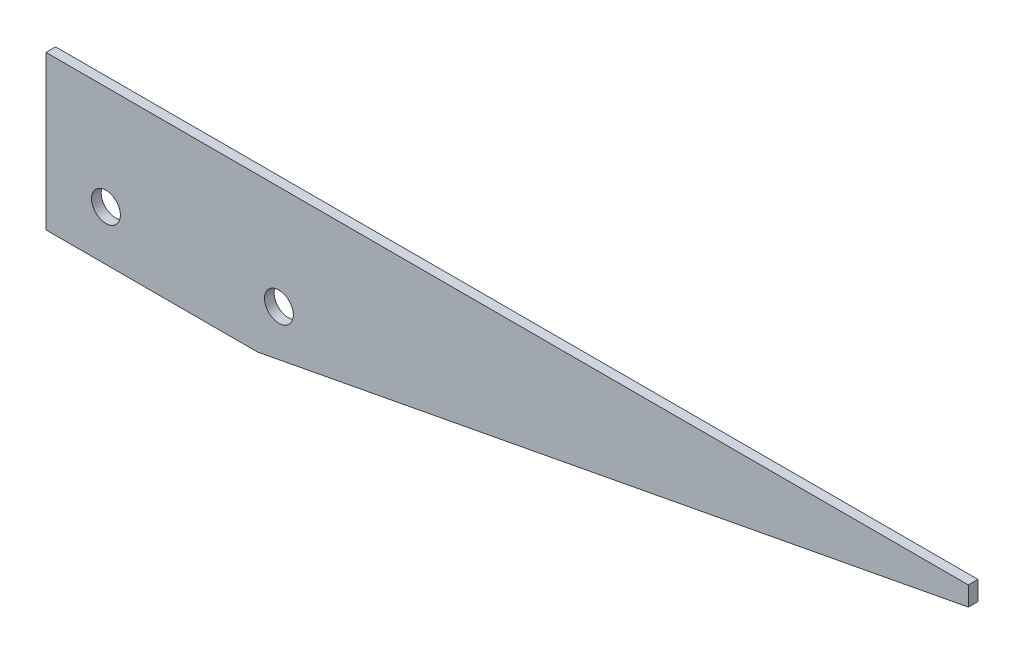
ISO-10303-21;
HEADER;
FILE_DESCRIPTION(('STEP AP214'),'2;1');
FILE_NAME('part.step','',(''),(''),'','','');
FILE_SCHEMA(('AUTOMOTIVE_DESIGN { 1 0 10303 214 1 1 1 1 }'));
ENDSEC;
DATA;
#1=APPLICATION_CONTEXT('core data for automotive mechanical design processes');
#2=APPLICATION_PROTOCOL_DEFINITION('international standard','automotive_design',2000,#1);
#3=PRODUCT_CONTEXT('',#1,'mechanical');
#4=PRODUCT('Part','Part','',(#3));
#5=PRODUCT_RELATED_PRODUCT_CATEGORY('part','',(#4));
#6=PRODUCT_DEFINITION_FORMATION('','',#4);
#7=PRODUCT_DEFINITION_CONTEXT('part definition',#1,'design');
#8=PRODUCT_DEFINITION('design','',#6,#7);
#9=PRODUCT_DEFINITION_SHAPE('','',#8);
#10=(LENGTH_UNIT() NAMED_UNIT(*) SI_UNIT(.MILLI.,.METRE.));
#11=(NAMED_UNIT(*) PLANE_ANGLE_UNIT() SI_UNIT($,.RADIAN.));
#12=(NAMED_UNIT(*) SI_UNIT($,.STERADIAN.) SOLID_ANGLE_UNIT());
#13=UNCERTAINTY_MEASURE_WITH_UNIT(LENGTH_MEASURE(1.E-05),#10,'distance_accuracy_value','');
#14=(GEOMETRIC_REPRESENTATION_CONTEXT(3) GLOBAL_UNCERTAINTY_ASSIGNED_CONTEXT((#13)) GLOBAL_UNIT_ASSIGNED_CONTEXT((#10,
#11,#12)) REPRESENTATION_CONTEXT('',''));
#15=CARTESIAN_POINT('',(0.,0.,0.));
#16=DIRECTION('',(0.,0.,1.));
#17=DIRECTION('',(1.,0.,0.));
#18=AXIS2_PLACEMENT_3D('',#15,#16,#17);
#19=CARTESIAN_POINT('',(0.,0.,3.17499999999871));
#20=DIRECTION('',(0.,0.,-1.));
#21=DIRECTION('',(-1.,0.,0.));
#22=AXIS2_PLACEMENT_3D('',#19,#20,#21);
#23=PLANE('',#22);
#24=CARTESIAN_POINT('',(-92.644451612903,3.19548387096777,3.17499999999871));
#25=DIRECTION('',(0.,0.,1.));
#26=DIRECTION('',(1.,0.,0.));
#27=AXIS2_PLACEMENT_3D('',#24,#25,#26);
#28=CIRCLE('',#27,4.7625);
#29=CARTESIAN_POINT('',(-87.881951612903,3.19548387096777,3.17499999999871));
#30=VERTEX_POINT('',#29);
#31=EDGE_CURVE('E119',#30,#30,#28,.T.);
#32=ORIENTED_EDGE('',*,*,#31,.F.);
#33=EDGE_LOOP('',(#32));
#34=FACE_BOUND('',#33,.T.);
#35=DIRECTION('',(0.,-1.,0.));
#36=VECTOR('',#35,1.);
#37=CARTESIAN_POINT('',(-112.456451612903,-13.3145161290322,3.17499999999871));
#38=LINE('',#37,#36);
#39=CARTESIAN_POINT('',(-112.456451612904,37.4854838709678,3.17499999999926));
#40=VERTEX_POINT('',#39);
#41=CARTESIAN_POINT('',(-112.456451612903,-13.3145161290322,3.17499999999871));
#42=VERTEX_POINT('',#41);
#43=EDGE_CURVE('E124',#40,#42,#38,.T.);
#44=ORIENTED_EDGE('',*,*,#43,.T.);
#45=DIRECTION('',(1.,0.,0.));
#46=VECTOR('',#45,1.);
#47=CARTESIAN_POINT('',(-42.6064516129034,-13.3145161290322,3.17499999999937));
#48=LINE('',#47,#46);
#49=CARTESIAN_POINT('',(-42.6064516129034,-13.3145161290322,3.17499999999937));
#50=VERTEX_POINT('',#49);
#51=EDGE_CURVE('E91',#42,#50,#48,.T.);
#52=ORIENTED_EDGE('',*,*,#51,.T.);
#53=DIRECTION('',(0.982570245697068,0.185891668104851,0.));
#54=VECTOR('',#53,1.);
#55=CARTESIAN_POINT('',(192.343548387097,31.1354838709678,3.17499999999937));
#56=LINE('',#55,#54);
#57=CARTESIAN_POINT('',(192.343548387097,31.1354838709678,3.17499999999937));
#58=VERTEX_POINT('',#57);
#59=EDGE_CURVE('E95',#50,#58,#56,.T.);
#60=ORIENTED_EDGE('',*,*,#59,.T.);
#61=DIRECTION('',(0.,1.,0.));
#62=VECTOR('',#61,1.);
#63=CARTESIAN_POINT('',(192.343548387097,37.4854838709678,3.17499999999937));
#64=LINE('',#63,#62);
#65=CARTESIAN_POINT('',(192.343548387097,37.4854838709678,3.17499999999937));
#66=VERTEX_POINT('',#65);
#67=EDGE_CURVE('E99',#58,#66,#64,.T.);
#68=ORIENTED_EDGE('',*,*,#67,.T.);
#69=DIRECTION('',(-1.,0.,0.));
#70=VECTOR('',#69,1.);
#71=CARTESIAN_POINT('',(-112.456451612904,37.4854838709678,3.17499999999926));
#72=LINE('',#71,#70);
#73=EDGE_CURVE('E57',#66,#40,#72,.T.);
#74=ORIENTED_EDGE('',*,*,#73,.T.);
#75=EDGE_LOOP('',(#44,#52,#60,#68,#74));
#76=FACE_BOUND('',#75,.T.);
#77=CARTESIAN_POINT('',(-35.4944516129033,3.19548387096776,3.17499999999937));
#78=DIRECTION('',(0.,0.,1.));
#79=DIRECTION('',(1.,0.,0.));
#80=AXIS2_PLACEMENT_3D('',#77,#78,#79);
#81=CIRCLE('',#80,4.7625);
#82=CARTESIAN_POINT('',(-30.7319516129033,3.19548387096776,3.17499999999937));
#83=VERTEX_POINT('',#82);
#84=EDGE_CURVE('E162',#83,#83,#81,.T.);
#85=ORIENTED_EDGE('',*,*,#84,.F.);
#86=EDGE_LOOP('',(#85));
#87=FACE_BOUND('',#86,.T.);
#88=ADVANCED_FACE('F40',(#34,#76,#87),#23,.F.);
#89=CARTESIAN_POINT('',(0.,0.,0.));
#90=DIRECTION('',(0.,0.,-1.));
#91=DIRECTION('',(-1.,0.,0.));
#92=AXIS2_PLACEMENT_3D('',#89,#90,#91);
#93=PLANE('',#92);
#94=CARTESIAN_POINT('',(-92.6444516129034,3.19548387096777,0.));
#95=DIRECTION('',(0.,0.,1.));
#96=DIRECTION('',(1.,0.,0.));
#97=AXIS2_PLACEMENT_3D('',#94,#95,#96);
#98=CIRCLE('',#97,4.7625);
#99=CARTESIAN_POINT('',(-87.8819516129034,3.19548387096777,0.));
#100=VERTEX_POINT('',#99);
#101=EDGE_CURVE('E167',#100,#100,#98,.T.);
#102=ORIENTED_EDGE('',*,*,#101,.T.);
#103=EDGE_LOOP('',(#102));
#104=FACE_BOUND('',#103,.T.);
#105=DIRECTION('',(0.,-1.,0.));
#106=VECTOR('',#105,1.);
#107=CARTESIAN_POINT('',(-112.456451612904,-13.3145161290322,0.));
#108=LINE('',#107,#106);
#109=CARTESIAN_POINT('',(-112.456451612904,37.4854838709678,0.));
#110=VERTEX_POINT('',#109);
#111=CARTESIAN_POINT('',(-112.456451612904,-13.3145161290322,0.));
#112=VERTEX_POINT('',#111);
#113=EDGE_CURVE('E115',#110,#112,#108,.T.);
#114=ORIENTED_EDGE('',*,*,#113,.F.);
#115=DIRECTION('',(-1.,0.,0.));
#116=VECTOR('',#115,1.);
#117=CARTESIAN_POINT('',(-112.456451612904,37.4854838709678,0.));
#118=LINE('',#117,#116);
#119=CARTESIAN_POINT('',(192.343548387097,37.4854838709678,-3.33066907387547E-13));
#120=VERTEX_POINT('',#119);
#121=EDGE_CURVE('E83',#120,#110,#118,.T.);
#122=ORIENTED_EDGE('',*,*,#121,.F.);
#123=DIRECTION('',(0.,1.,0.));
#124=VECTOR('',#123,1.);
#125=CARTESIAN_POINT('',(192.343548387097,37.4854838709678,-3.33066907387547E-13));
#126=LINE('',#125,#124);
#127=CARTESIAN_POINT('',(192.343548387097,31.1354838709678,-3.33066907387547E-13));
#128=VERTEX_POINT('',#127);
#129=EDGE_CURVE('E77',#128,#120,#126,.T.);
#130=ORIENTED_EDGE('',*,*,#129,.F.);
#131=DIRECTION('',(0.982570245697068,0.185891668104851,0.));
#132=VECTOR('',#131,1.);
#133=CARTESIAN_POINT('',(192.343548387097,31.1354838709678,-3.33066907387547E-13));
#134=LINE('',#133,#132);
#135=CARTESIAN_POINT('',(-42.6064516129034,-13.3145161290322,-6.66133814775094E-13));
#136=VERTEX_POINT('',#135);
#137=EDGE_CURVE('E106',#136,#128,#134,.T.);
#138=ORIENTED_EDGE('',*,*,#137,.F.);
#139=DIRECTION('',(1.,0.,0.));
#140=VECTOR('',#139,1.);
#141=CARTESIAN_POINT('',(-42.6064516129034,-13.3145161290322,-6.66133814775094E-13));
#142=LINE('',#141,#140);
#143=EDGE_CURVE('E118',#112,#136,#142,.T.);
#144=ORIENTED_EDGE('',*,*,#143,.F.);
#145=EDGE_LOOP('',(#114,#122,#130,#138,#144));
#146=FACE_BOUND('',#145,.T.);
#147=CARTESIAN_POINT('',(-35.4944516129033,3.19548387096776,-6.66133814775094E-13));
#148=DIRECTION('',(0.,0.,1.));
#149=DIRECTION('',(1.,0.,0.));
#150=AXIS2_PLACEMENT_3D('',#147,#148,#149);
#151=CIRCLE('',#150,4.7625);
#152=CARTESIAN_POINT('',(-30.7319516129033,3.19548387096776,-6.66133814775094E-13));
#153=VERTEX_POINT('',#152);
#154=EDGE_CURVE('E165',#153,#153,#151,.T.);
#155=ORIENTED_EDGE('',*,*,#154,.T.);
#156=EDGE_LOOP('',(#155));
#157=FACE_BOUND('',#156,.T.);
#158=ADVANCED_FACE('F128',(#104,#146,#157),#93,.T.);
#159=CARTESIAN_POINT('',(-112.456451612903,-13.3145161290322,3.17499999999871));
#160=DIRECTION('',(1.,0.,0.));
#161=DIRECTION('',(0.,0.,-1.));
#162=AXIS2_PLACEMENT_3D('',#159,#160,#161);
#163=PLANE('',#162);
#164=ORIENTED_EDGE('',*,*,#113,.T.);
#165=DIRECTION('',(0.,0.,-1.));
#166=VECTOR('',#165,1.);
#167=CARTESIAN_POINT('',(-112.456451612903,-13.3145161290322,3.17499999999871));
#168=LINE('',#167,#166);
#169=EDGE_CURVE('E13',#42,#112,#168,.T.);
#170=ORIENTED_EDGE('',*,*,#169,.F.);
#171=ORIENTED_EDGE('',*,*,#43,.F.);
#172=DIRECTION('',(0.,0.,-1.));
#173=VECTOR('',#172,1.);
#174=CARTESIAN_POINT('',(-112.456451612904,37.4854838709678,3.17499999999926));
#175=LINE('',#174,#173);
#176=EDGE_CURVE('E111',#40,#110,#175,.T.);
#177=ORIENTED_EDGE('',*,*,#176,.T.);
#178=EDGE_LOOP('',(#164,#170,#171,#177));
#179=FACE_BOUND('',#178,.T.);
#180=ADVANCED_FACE('F42',(#179),#163,.F.);
#181=CARTESIAN_POINT('',(-42.6064516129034,-13.3145161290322,3.17499999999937));
#182=DIRECTION('',(0.,1.,0.));
#183=DIRECTION('',(-1.,0.,0.));
#184=AXIS2_PLACEMENT_3D('',#181,#182,#183);
#185=PLANE('',#184);
#186=ORIENTED_EDGE('',*,*,#143,.T.);
#187=DIRECTION('',(0.,0.,-1.));
#188=VECTOR('',#187,1.);
#189=CARTESIAN_POINT('',(-42.6064516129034,-13.3145161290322,3.17499999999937));
#190=LINE('',#189,#188);
#191=EDGE_CURVE('E49',#50,#136,#190,.T.);
#192=ORIENTED_EDGE('',*,*,#191,.F.);
#193=ORIENTED_EDGE('',*,*,#51,.F.);
#194=ORIENTED_EDGE('',*,*,#169,.T.);
#195=EDGE_LOOP('',(#186,#192,#193,#194));
#196=FACE_BOUND('',#195,.T.);
#197=ADVANCED_FACE('F193',(#196),#185,.F.);
#198=CARTESIAN_POINT('',(192.343548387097,31.1354838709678,3.17499999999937));
#199=DIRECTION('',(-0.185891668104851,0.982570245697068,0.));
#200=DIRECTION('',(-0.982570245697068,-0.185891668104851,0.));
#201=AXIS2_PLACEMENT_3D('',#198,#199,#200);
#202=PLANE('',#201);
#203=ORIENTED_EDGE('',*,*,#137,.T.);
#204=DIRECTION('',(0.,0.,-1.));
#205=VECTOR('',#204,1.);
#206=CARTESIAN_POINT('',(192.343548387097,31.1354838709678,3.17499999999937));
#207=LINE('',#206,#205);
#208=EDGE_CURVE('E103',#58,#128,#207,.T.);
#209=ORIENTED_EDGE('',*,*,#208,.F.);
#210=ORIENTED_EDGE('',*,*,#59,.F.);
#211=ORIENTED_EDGE('',*,*,#191,.T.);
#212=EDGE_LOOP('',(#203,#209,#210,#211));
#213=FACE_BOUND('',#212,.T.);
#214=ADVANCED_FACE('F104',(#213),#202,.F.);
#215=CARTESIAN_POINT('',(192.343548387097,37.4854838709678,3.17499999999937));
#216=DIRECTION('',(-1.,0.,0.));
#217=DIRECTION('',(0.,0.,1.));
#218=AXIS2_PLACEMENT_3D('',#215,#216,#217);
#219=PLANE('',#218);
#220=ORIENTED_EDGE('',*,*,#129,.T.);
#221=DIRECTION('',(0.,0.,-1.));
#222=VECTOR('',#221,1.);
#223=CARTESIAN_POINT('',(192.343548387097,37.4854838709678,3.17499999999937));
#224=LINE('',#223,#222);
#225=EDGE_CURVE('E107',#66,#120,#224,.T.);
#226=ORIENTED_EDGE('',*,*,#225,.F.);
#227=ORIENTED_EDGE('',*,*,#67,.F.);
#228=ORIENTED_EDGE('',*,*,#208,.T.);
#229=EDGE_LOOP('',(#220,#226,#227,#228));
#230=FACE_BOUND('',#229,.T.);
#231=ADVANCED_FACE('F109',(#230),#219,.F.);
#232=CARTESIAN_POINT('',(-112.456451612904,37.4854838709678,3.17499999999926));
#233=DIRECTION('',(0.,-1.,0.));
#234=DIRECTION('',(0.,0.,-1.));
#235=AXIS2_PLACEMENT_3D('',#232,#233,#234);
#236=PLANE('',#235);
#237=ORIENTED_EDGE('',*,*,#121,.T.);
#238=ORIENTED_EDGE('',*,*,#176,.F.);
#239=ORIENTED_EDGE('',*,*,#73,.F.);
#240=ORIENTED_EDGE('',*,*,#225,.T.);
#241=EDGE_LOOP('',(#237,#238,#239,#240));
#242=FACE_BOUND('',#241,.T.);
#243=ADVANCED_FACE('F133',(#242),#236,.F.);
#244=CARTESIAN_POINT('',(-92.644451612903,3.19548387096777,3.17499999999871));
#245=DIRECTION('',(0.,0.,-1.));
#246=DIRECTION('',(-1.,0.,0.));
#247=AXIS2_PLACEMENT_3D('',#244,#245,#246);
#248=CYLINDRICAL_SURFACE('',#247,4.7625);
#249=ORIENTED_EDGE('',*,*,#31,.T.);
#250=EDGE_LOOP('',(#249));
#251=FACE_BOUND('',#250,.T.);
#252=ORIENTED_EDGE('',*,*,#101,.F.);
#253=EDGE_LOOP('',(#252));
#254=FACE_BOUND('',#253,.T.);
#255=ADVANCED_FACE('F135',(#251,#254),#248,.F.);
#256=CARTESIAN_POINT('',(-35.4944516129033,3.19548387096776,3.17499999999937));
#257=DIRECTION('',(0.,0.,-1.));
#258=DIRECTION('',(-1.,0.,0.));
#259=AXIS2_PLACEMENT_3D('',#256,#257,#258);
#260=CYLINDRICAL_SURFACE('',#259,4.7625);
#261=ORIENTED_EDGE('',*,*,#84,.T.);
#262=EDGE_LOOP('',(#261));
#263=FACE_BOUND('',#262,.T.);
#264=ORIENTED_EDGE('',*,*,#154,.F.);
#265=EDGE_LOOP('',(#264));
#266=FACE_BOUND('',#265,.T.);
#267=ADVANCED_FACE('F141',(#263,#266),#260,.F.);
#268=CLOSED_SHELL('',(#88,#158,#180,#197,#214,#231,#243,#255,#267));
#269=MANIFOLD_SOLID_BREP('B2',#268);
#270=ADVANCED_BREP_SHAPE_REPRESENTATION('',(#18,#269),#14);
#271=SHAPE_DEFINITION_REPRESENTATION(#9,#270);
ENDSEC;
END-ISO-10303-21;
